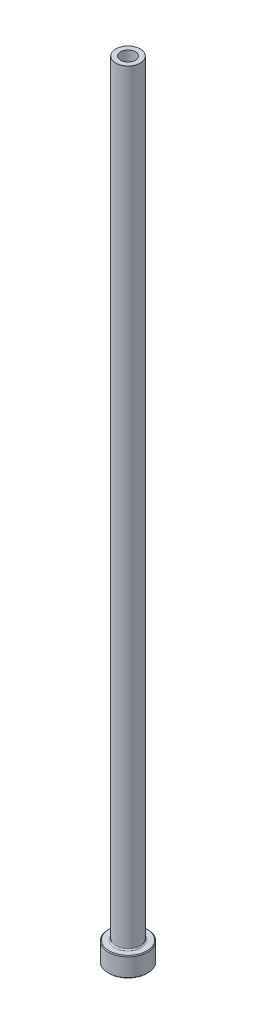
ISO-10303-21;
HEADER;
FILE_DESCRIPTION(('STEP AP214'),'2;1');
FILE_NAME('part.step','',(''),(''),'','','');
FILE_SCHEMA(('AUTOMOTIVE_DESIGN { 1 0 10303 214 1 1 1 1 }'));
ENDSEC;
DATA;
#1=APPLICATION_CONTEXT('core data for automotive mechanical design processes');
#2=APPLICATION_PROTOCOL_DEFINITION('international standard','automotive_design',2000,#1);
#3=PRODUCT_CONTEXT('',#1,'mechanical');
#4=PRODUCT('Part','Part','',(#3));
#5=PRODUCT_RELATED_PRODUCT_CATEGORY('part','',(#4));
#6=PRODUCT_DEFINITION_FORMATION('','',#4);
#7=PRODUCT_DEFINITION_CONTEXT('part definition',#1,'design');
#8=PRODUCT_DEFINITION('design','',#6,#7);
#9=PRODUCT_DEFINITION_SHAPE('','',#8);
#10=(LENGTH_UNIT() NAMED_UNIT(*) SI_UNIT(.MILLI.,.METRE.));
#11=(NAMED_UNIT(*) PLANE_ANGLE_UNIT() SI_UNIT($,.RADIAN.));
#12=(NAMED_UNIT(*) SI_UNIT($,.STERADIAN.) SOLID_ANGLE_UNIT());
#13=UNCERTAINTY_MEASURE_WITH_UNIT(LENGTH_MEASURE(1.E-05),#10,'distance_accuracy_value','');
#14=(GEOMETRIC_REPRESENTATION_CONTEXT(3) GLOBAL_UNCERTAINTY_ASSIGNED_CONTEXT((#13)) GLOBAL_UNIT_ASSIGNED_CONTEXT((#10,
#11,#12)) REPRESENTATION_CONTEXT('',''));
#15=CARTESIAN_POINT('',(0.,0.,0.));
#16=DIRECTION('',(0.,0.,1.));
#17=DIRECTION('',(1.,0.,0.));
#18=AXIS2_PLACEMENT_3D('',#15,#16,#17);
#19=CARTESIAN_POINT('',(0.,0.,0.));
#20=DIRECTION('',(0.,-1.,0.));
#21=DIRECTION('',(0.,0.,-1.));
#22=AXIS2_PLACEMENT_3D('',#19,#20,#21);
#23=PLANE('',#22);
#24=CARTESIAN_POINT('',(0.,0.,0.));
#25=DIRECTION('',(0.,-1.,0.));
#26=DIRECTION('',(0.,0.,-1.));
#27=AXIS2_PLACEMENT_3D('',#24,#25,#26);
#28=CIRCLE('',#27,6.09599999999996);
#29=CARTESIAN_POINT('',(0.,0.,-6.09599999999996));
#30=VERTEX_POINT('',#29);
#31=EDGE_CURVE('E44',#30,#30,#28,.T.);
#32=ORIENTED_EDGE('',*,*,#31,.T.);
#33=EDGE_LOOP('',(#32));
#34=FACE_BOUND('',#33,.T.);
#35=CARTESIAN_POINT('',(0.,0.,0.));
#36=DIRECTION('',(0.,-1.,0.));
#37=DIRECTION('',(0.,0.,-1.));
#38=AXIS2_PLACEMENT_3D('',#35,#36,#37);
#39=CIRCLE('',#38,2.968625);
#40=CARTESIAN_POINT('',(0.,0.,-2.968625));
#41=VERTEX_POINT('',#40);
#42=EDGE_CURVE('E58',#41,#41,#39,.T.);
#43=ORIENTED_EDGE('',*,*,#42,.F.);
#44=EDGE_LOOP('',(#43));
#45=FACE_BOUND('',#44,.T.);
#46=ADVANCED_FACE('F29',(#34,#45),#23,.T.);
#47=CARTESIAN_POINT('',(0.,0.,0.));
#48=DIRECTION('',(0.,-1.,0.));
#49=DIRECTION('',(0.,0.,-1.));
#50=AXIS2_PLACEMENT_3D('',#47,#48,#49);
#51=CYLINDRICAL_SURFACE('',#50,6.35);
#52=CARTESIAN_POINT('',(0.,0.254000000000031,0.));
#53=DIRECTION('',(0.,-1.,0.));
#54=DIRECTION('',(0.,0.,-1.));
#55=AXIS2_PLACEMENT_3D('',#52,#53,#54);
#56=CIRCLE('',#55,6.35);
#57=CARTESIAN_POINT('',(0.,0.254000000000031,-6.35));
#58=VERTEX_POINT('',#57);
#59=EDGE_CURVE('E36',#58,#58,#56,.F.);
#60=ORIENTED_EDGE('',*,*,#59,.T.);
#61=EDGE_LOOP('',(#60));
#62=FACE_BOUND('',#61,.T.);
#63=CARTESIAN_POINT('',(0.,6.09599999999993,0.));
#64=DIRECTION('',(0.,1.,0.));
#65=DIRECTION('',(0.,0.,1.));
#66=AXIS2_PLACEMENT_3D('',#63,#64,#65);
#67=CIRCLE('',#66,6.35);
#68=CARTESIAN_POINT('',(0.,6.09599999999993,6.35));
#69=VERTEX_POINT('',#68);
#70=EDGE_CURVE('E40',#69,#69,#67,.F.);
#71=ORIENTED_EDGE('',*,*,#70,.T.);
#72=EDGE_LOOP('',(#71));
#73=FACE_BOUND('',#72,.T.);
#74=ADVANCED_FACE('F103',(#62,#73),#51,.T.);
#75=CARTESIAN_POINT('',(6.35,6.35,0.));
#76=DIRECTION('',(0.,1.,0.));
#77=DIRECTION('',(0.,0.,1.));
#78=AXIS2_PLACEMENT_3D('',#75,#76,#77);
#79=PLANE('',#78);
#80=CARTESIAN_POINT('',(0.,6.35,0.));
#81=DIRECTION('',(0.,1.,0.));
#82=DIRECTION('',(0.,0.,1.));
#83=AXIS2_PLACEMENT_3D('',#80,#81,#82);
#84=CIRCLE('',#83,6.09599999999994);
#85=CARTESIAN_POINT('',(0.,6.35,6.09599999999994));
#86=VERTEX_POINT('',#85);
#87=EDGE_CURVE('E10',#86,#86,#84,.T.);
#88=ORIENTED_EDGE('',*,*,#87,.T.);
#89=EDGE_LOOP('',(#88));
#90=FACE_BOUND('',#89,.T.);
#91=CARTESIAN_POINT('',(0.,6.35,0.));
#92=DIRECTION('',(0.,-1.,0.));
#93=DIRECTION('',(0.,0.,-1.));
#94=AXIS2_PLACEMENT_3D('',#91,#92,#93);
#95=CIRCLE('',#94,4.359275);
#96=CARTESIAN_POINT('',(0.,6.35,-4.359275));
#97=VERTEX_POINT('',#96);
#98=EDGE_CURVE('E49',#97,#97,#95,.T.);
#99=ORIENTED_EDGE('',*,*,#98,.T.);
#100=EDGE_LOOP('',(#99));
#101=FACE_BOUND('',#100,.T.);
#102=ADVANCED_FACE('F109',(#90,#101),#79,.T.);
#103=CARTESIAN_POINT('',(0.,6.746875,0.));
#104=DIRECTION('',(0.,-1.,0.));
#105=DIRECTION('',(0.,0.,-1.));
#106=AXIS2_PLACEMENT_3D('',#103,#104,#105);
#107=TOROIDAL_SURFACE('',#106,4.359275,0.396875);
#108=CARTESIAN_POINT('',(0.,6.746875,0.));
#109=DIRECTION('',(0.,-1.,0.));
#110=DIRECTION('',(0.,0.,-1.));
#111=AXIS2_PLACEMENT_3D('',#108,#109,#110);
#112=CIRCLE('',#111,3.9624);
#113=CARTESIAN_POINT('',(0.,6.746875,-3.9624));
#114=VERTEX_POINT('',#113);
#115=EDGE_CURVE('E52',#114,#114,#112,.T.);
#116=ORIENTED_EDGE('',*,*,#115,.T.);
#117=EDGE_LOOP('',(#116));
#118=FACE_BOUND('',#117,.T.);
#119=ORIENTED_EDGE('',*,*,#98,.F.);
#120=EDGE_LOOP('',(#119));
#121=FACE_BOUND('',#120,.T.);
#122=ADVANCED_FACE('F139',(#118,#121),#107,.F.);
#123=CARTESIAN_POINT('',(0.,0.,0.));
#124=DIRECTION('',(0.,-1.,0.));
#125=DIRECTION('',(0.,0.,-1.));
#126=AXIS2_PLACEMENT_3D('',#123,#124,#125);
#127=CYLINDRICAL_SURFACE('',#126,3.9624);
#128=CARTESIAN_POINT('',(0.,254.,0.));
#129=DIRECTION('',(0.,-1.,0.));
#130=DIRECTION('',(0.,0.,-1.));
#131=AXIS2_PLACEMENT_3D('',#128,#129,#130);
#132=CIRCLE('',#131,3.9624);
#133=CARTESIAN_POINT('',(0.,254.,-3.9624));
#134=VERTEX_POINT('',#133);
#135=EDGE_CURVE('E55',#134,#134,#132,.T.);
#136=ORIENTED_EDGE('',*,*,#135,.T.);
#137=EDGE_LOOP('',(#136));
#138=FACE_BOUND('',#137,.T.);
#139=ORIENTED_EDGE('',*,*,#115,.F.);
#140=EDGE_LOOP('',(#139));
#141=FACE_BOUND('',#140,.T.);
#142=ADVANCED_FACE('F182',(#138,#141),#127,.T.);
#143=CARTESIAN_POINT('',(3.9624,254.,0.));
#144=DIRECTION('',(0.,1.,0.));
#145=DIRECTION('',(0.,0.,1.));
#146=AXIS2_PLACEMENT_3D('',#143,#144,#145);
#147=PLANE('',#146);
#148=CARTESIAN_POINT('',(0.,254.,0.));
#149=DIRECTION('',(0.,-1.,0.));
#150=DIRECTION('',(0.,0.,-1.));
#151=AXIS2_PLACEMENT_3D('',#148,#149,#150);
#152=CIRCLE('',#151,2.38125);
#153=CARTESIAN_POINT('',(0.,254.,-2.38125));
#154=VERTEX_POINT('',#153);
#155=EDGE_CURVE('E70',#154,#154,#152,.T.);
#156=ORIENTED_EDGE('',*,*,#155,.T.);
#157=EDGE_LOOP('',(#156));
#158=FACE_BOUND('',#157,.T.);
#159=ORIENTED_EDGE('',*,*,#135,.F.);
#160=EDGE_LOOP('',(#159));
#161=FACE_BOUND('',#160,.T.);
#162=ADVANCED_FACE('F74',(#158,#161),#147,.T.);
#163=CARTESIAN_POINT('',(0.,0.,0.));
#164=DIRECTION('',(0.,-1.,0.));
#165=DIRECTION('',(0.,0.,-1.));
#166=AXIS2_PLACEMENT_3D('',#163,#164,#165);
#167=CONICAL_SURFACE('',#166,2.968625,0.785398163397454);
#168=CARTESIAN_POINT('',(0.,0.396875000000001,0.));
#169=DIRECTION('',(0.,-1.,0.));
#170=DIRECTION('',(0.,0.,-1.));
#171=AXIS2_PLACEMENT_3D('',#168,#169,#170);
#172=CIRCLE('',#171,2.57175);
#173=CARTESIAN_POINT('',(0.,0.396875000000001,-2.57175));
#174=VERTEX_POINT('',#173);
#175=EDGE_CURVE('E61',#174,#174,#172,.T.);
#176=ORIENTED_EDGE('',*,*,#175,.F.);
#177=EDGE_LOOP('',(#176));
#178=FACE_BOUND('',#177,.T.);
#179=ORIENTED_EDGE('',*,*,#42,.T.);
#180=EDGE_LOOP('',(#179));
#181=FACE_BOUND('',#180,.T.);
#182=ADVANCED_FACE('F93',(#178,#181),#167,.F.);
#183=CARTESIAN_POINT('',(0.,0.,0.));
#184=DIRECTION('',(0.,-1.,0.));
#185=DIRECTION('',(0.,0.,-1.));
#186=AXIS2_PLACEMENT_3D('',#183,#184,#185);
#187=CYLINDRICAL_SURFACE('',#186,2.57175);
#188=CARTESIAN_POINT('',(0.,179.5145,0.));
#189=DIRECTION('',(0.,-1.,0.));
#190=DIRECTION('',(0.,0.,-1.));
#191=AXIS2_PLACEMENT_3D('',#188,#189,#190);
#192=CIRCLE('',#191,2.57175);
#193=CARTESIAN_POINT('',(0.,179.5145,-2.57175));
#194=VERTEX_POINT('',#193);
#195=EDGE_CURVE('E64',#194,#194,#192,.T.);
#196=ORIENTED_EDGE('',*,*,#195,.F.);
#197=EDGE_LOOP('',(#196));
#198=FACE_BOUND('',#197,.T.);
#199=ORIENTED_EDGE('',*,*,#175,.T.);
#200=EDGE_LOOP('',(#199));
#201=FACE_BOUND('',#200,.T.);
#202=ADVANCED_FACE('F87',(#198,#201),#187,.F.);
#203=CARTESIAN_POINT('',(0.,179.5145,0.));
#204=DIRECTION('',(0.,-1.,0.));
#205=DIRECTION('',(0.,0.,-1.));
#206=AXIS2_PLACEMENT_3D('',#203,#204,#205);
#207=CONICAL_SURFACE('',#206,2.57175,0.0133325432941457);
#208=CARTESIAN_POINT('',(0.,193.802,0.));
#209=DIRECTION('',(0.,-1.,0.));
#210=DIRECTION('',(0.,0.,-1.));
#211=AXIS2_PLACEMENT_3D('',#208,#209,#210);
#212=CIRCLE('',#211,2.38125);
#213=CARTESIAN_POINT('',(0.,193.802,-2.38125));
#214=VERTEX_POINT('',#213);
#215=EDGE_CURVE('E67',#214,#214,#212,.T.);
#216=ORIENTED_EDGE('',*,*,#215,.F.);
#217=EDGE_LOOP('',(#216));
#218=FACE_BOUND('',#217,.T.);
#219=ORIENTED_EDGE('',*,*,#195,.T.);
#220=EDGE_LOOP('',(#219));
#221=FACE_BOUND('',#220,.T.);
#222=ADVANCED_FACE('F81',(#218,#221),#207,.F.);
#223=CARTESIAN_POINT('',(0.,0.,0.));
#224=DIRECTION('',(0.,-1.,0.));
#225=DIRECTION('',(0.,0.,-1.));
#226=AXIS2_PLACEMENT_3D('',#223,#224,#225);
#227=CYLINDRICAL_SURFACE('',#226,2.38125);
#228=ORIENTED_EDGE('',*,*,#155,.F.);
#229=EDGE_LOOP('',(#228));
#230=FACE_BOUND('',#229,.T.);
#231=ORIENTED_EDGE('',*,*,#215,.T.);
#232=EDGE_LOOP('',(#231));
#233=FACE_BOUND('',#232,.T.);
#234=ADVANCED_FACE('F77',(#230,#233),#227,.F.);
#235=CARTESIAN_POINT('',(0.,0.,0.));
#236=DIRECTION('',(0.,1.,0.));
#237=DIRECTION('',(0.,0.,1.));
#238=AXIS2_PLACEMENT_3D('',#235,#236,#237);
#239=CONICAL_SURFACE('',#238,6.09599999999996,0.78539816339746);
#240=ORIENTED_EDGE('',*,*,#59,.F.);
#241=EDGE_LOOP('',(#240));
#242=FACE_BOUND('',#241,.T.);
#243=ORIENTED_EDGE('',*,*,#31,.F.);
#244=EDGE_LOOP('',(#243));
#245=FACE_BOUND('',#244,.T.);
#246=ADVANCED_FACE('F80',(#242,#245),#239,.T.);
#247=CARTESIAN_POINT('',(0.,6.09599999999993,0.));
#248=DIRECTION('',(0.,-1.,0.));
#249=DIRECTION('',(0.,0.,-1.));
#250=AXIS2_PLACEMENT_3D('',#247,#248,#249);
#251=CONICAL_SURFACE('',#250,6.35,0.785398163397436);
#252=ORIENTED_EDGE('',*,*,#87,.F.);
#253=EDGE_LOOP('',(#252));
#254=FACE_BOUND('',#253,.T.);
#255=ORIENTED_EDGE('',*,*,#70,.F.);
#256=EDGE_LOOP('',(#255));
#257=FACE_BOUND('',#256,.T.);
#258=ADVANCED_FACE('F31',(#254,#257),#251,.T.);
#259=CLOSED_SHELL('',(#46,#74,#102,#122,#142,#162,#182,#202,#222,#234,#246,#258));
#260=MANIFOLD_SOLID_BREP('B2',#259);
#261=ADVANCED_BREP_SHAPE_REPRESENTATION('',(#18,#260),#14);
#262=SHAPE_DEFINITION_REPRESENTATION(#9,#261);
ENDSEC;
END-ISO-10303-21;
